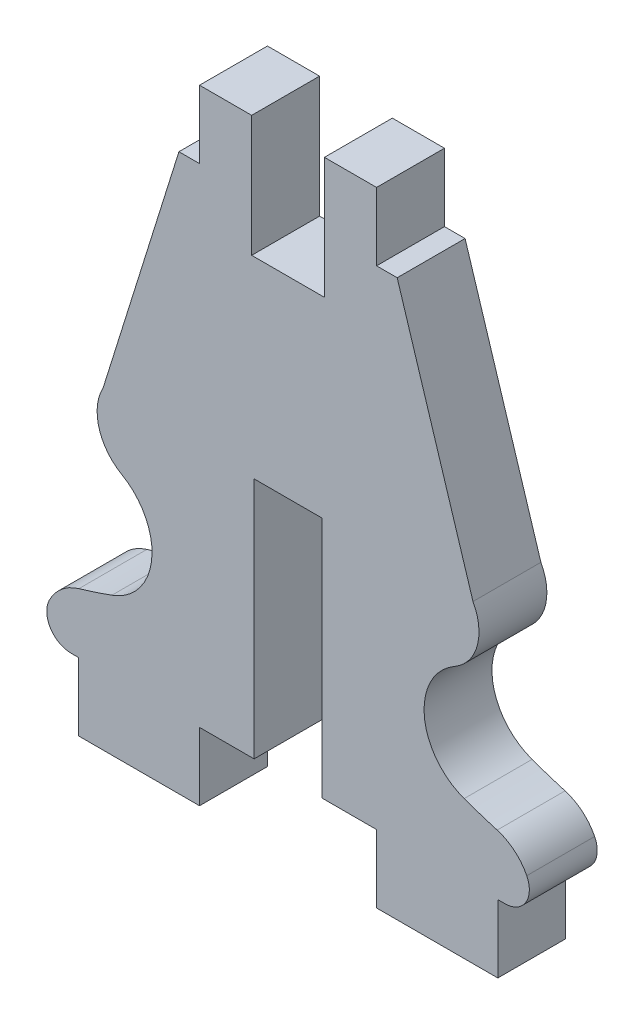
ISO-10303-21;
HEADER;
FILE_DESCRIPTION(('STEP AP214'),'2;1');
FILE_NAME('part.step','',(''),(''),'','','');
FILE_SCHEMA(('AUTOMOTIVE_DESIGN { 1 0 10303 214 1 1 1 1 }'));
ENDSEC;
DATA;
#1=APPLICATION_CONTEXT('core data for automotive mechanical design processes');
#2=APPLICATION_PROTOCOL_DEFINITION('international standard','automotive_design',2000,#1);
#3=PRODUCT_CONTEXT('',#1,'mechanical');
#4=PRODUCT('Part','Part','',(#3));
#5=PRODUCT_RELATED_PRODUCT_CATEGORY('part','',(#4));
#6=PRODUCT_DEFINITION_FORMATION('','',#4);
#7=PRODUCT_DEFINITION_CONTEXT('part definition',#1,'design');
#8=PRODUCT_DEFINITION('design','',#6,#7);
#9=PRODUCT_DEFINITION_SHAPE('','',#8);
#10=(LENGTH_UNIT() NAMED_UNIT(*) SI_UNIT(.MILLI.,.METRE.));
#11=(NAMED_UNIT(*) PLANE_ANGLE_UNIT() SI_UNIT($,.RADIAN.));
#12=(NAMED_UNIT(*) SI_UNIT($,.STERADIAN.) SOLID_ANGLE_UNIT());
#13=UNCERTAINTY_MEASURE_WITH_UNIT(LENGTH_MEASURE(1.E-05),#10,'distance_accuracy_value','');
#14=(GEOMETRIC_REPRESENTATION_CONTEXT(3) GLOBAL_UNCERTAINTY_ASSIGNED_CONTEXT((#13)) GLOBAL_UNIT_ASSIGNED_CONTEXT((#10,
#11,#12)) REPRESENTATION_CONTEXT('',''));
#15=CARTESIAN_POINT('',(0.,0.,0.));
#16=DIRECTION('',(0.,0.,1.));
#17=DIRECTION('',(1.,0.,0.));
#18=AXIS2_PLACEMENT_3D('',#15,#16,#17);
#19=CARTESIAN_POINT('',(-3.65,-2.8,2.8));
#20=DIRECTION('',(0.,1.,0.));
#21=DIRECTION('',(-1.,0.,0.));
#22=AXIS2_PLACEMENT_3D('',#19,#20,#21);
#23=PLANE('',#22);
#24=DIRECTION('',(1.,0.,0.));
#25=VECTOR('',#24,1.);
#26=CARTESIAN_POINT('',(-3.65,-2.8,0.));
#27=LINE('',#26,#25);
#28=CARTESIAN_POINT('',(-8.65,-2.8,0.));
#29=VERTEX_POINT('',#28);
#30=CARTESIAN_POINT('',(-3.65,-2.8,0.));
#31=VERTEX_POINT('',#30);
#32=EDGE_CURVE('E300',#29,#31,#27,.T.);
#33=ORIENTED_EDGE('',*,*,#32,.T.);
#34=DIRECTION('',(0.,0.,-1.));
#35=VECTOR('',#34,1.);
#36=CARTESIAN_POINT('',(-3.65,-2.8,2.8));
#37=LINE('',#36,#35);
#38=CARTESIAN_POINT('',(-3.65,-2.8,2.8));
#39=VERTEX_POINT('',#38);
#40=EDGE_CURVE('E11',#39,#31,#37,.T.);
#41=ORIENTED_EDGE('',*,*,#40,.F.);
#42=DIRECTION('',(1.,0.,0.));
#43=VECTOR('',#42,1.);
#44=CARTESIAN_POINT('',(-3.65,-2.8,2.8));
#45=LINE('',#44,#43);
#46=CARTESIAN_POINT('',(-8.65,-2.8,2.8));
#47=VERTEX_POINT('',#46);
#48=EDGE_CURVE('E400',#47,#39,#45,.T.);
#49=ORIENTED_EDGE('',*,*,#48,.F.);
#50=DIRECTION('',(0.,0.,-1.));
#51=VECTOR('',#50,1.);
#52=CARTESIAN_POINT('',(-8.65,-2.8,2.8));
#53=LINE('',#52,#51);
#54=EDGE_CURVE('E296',#47,#29,#53,.T.);
#55=ORIENTED_EDGE('',*,*,#54,.T.);
#56=EDGE_LOOP('',(#33,#41,#49,#55));
#57=FACE_BOUND('',#56,.T.);
#58=ADVANCED_FACE('F43',(#57),#23,.F.);
#59=CARTESIAN_POINT('',(-3.65,0.,2.8));
#60=DIRECTION('',(-1.,0.,0.));
#61=DIRECTION('',(0.,-1.,0.));
#62=AXIS2_PLACEMENT_3D('',#59,#60,#61);
#63=PLANE('',#62);
#64=DIRECTION('',(0.,1.,0.));
#65=VECTOR('',#64,1.);
#66=CARTESIAN_POINT('',(-3.65,0.,0.));
#67=LINE('',#66,#65);
#68=CARTESIAN_POINT('',(-3.65,0.,0.));
#69=VERTEX_POINT('',#68);
#70=EDGE_CURVE('E304',#31,#69,#67,.T.);
#71=ORIENTED_EDGE('',*,*,#70,.T.);
#72=DIRECTION('',(0.,0.,-1.));
#73=VECTOR('',#72,1.);
#74=CARTESIAN_POINT('',(-3.65,0.,2.8));
#75=LINE('',#74,#73);
#76=CARTESIAN_POINT('',(-3.65,0.,2.8));
#77=VERTEX_POINT('',#76);
#78=EDGE_CURVE('E52',#77,#69,#75,.T.);
#79=ORIENTED_EDGE('',*,*,#78,.F.);
#80=DIRECTION('',(0.,1.,0.));
#81=VECTOR('',#80,1.);
#82=CARTESIAN_POINT('',(-3.65,0.,2.8));
#83=LINE('',#82,#81);
#84=EDGE_CURVE('E181',#39,#77,#83,.T.);
#85=ORIENTED_EDGE('',*,*,#84,.F.);
#86=ORIENTED_EDGE('',*,*,#40,.T.);
#87=EDGE_LOOP('',(#71,#79,#85,#86));
#88=FACE_BOUND('',#87,.T.);
#89=ADVANCED_FACE('F648',(#88),#63,.F.);
#90=CARTESIAN_POINT('',(-1.4,0.,2.8));
#91=DIRECTION('',(0.,1.,0.));
#92=DIRECTION('',(-1.,0.,0.));
#93=AXIS2_PLACEMENT_3D('',#90,#91,#92);
#94=PLANE('',#93);
#95=DIRECTION('',(1.,0.,0.));
#96=VECTOR('',#95,1.);
#97=CARTESIAN_POINT('',(-1.4,0.,0.));
#98=LINE('',#97,#96);
#99=CARTESIAN_POINT('',(-1.4,0.,0.));
#100=VERTEX_POINT('',#99);
#101=EDGE_CURVE('E307',#69,#100,#98,.T.);
#102=ORIENTED_EDGE('',*,*,#101,.T.);
#103=DIRECTION('',(0.,0.,-1.));
#104=VECTOR('',#103,1.);
#105=CARTESIAN_POINT('',(-1.4,0.,2.8));
#106=LINE('',#105,#104);
#107=CARTESIAN_POINT('',(-1.4,0.,2.8));
#108=VERTEX_POINT('',#107);
#109=EDGE_CURVE('E515',#108,#100,#106,.T.);
#110=ORIENTED_EDGE('',*,*,#109,.F.);
#111=DIRECTION('',(1.,0.,0.));
#112=VECTOR('',#111,1.);
#113=CARTESIAN_POINT('',(-1.4,0.,2.8));
#114=LINE('',#113,#112);
#115=EDGE_CURVE('E525',#77,#108,#114,.T.);
#116=ORIENTED_EDGE('',*,*,#115,.F.);
#117=ORIENTED_EDGE('',*,*,#78,.T.);
#118=EDGE_LOOP('',(#102,#110,#116,#117));
#119=FACE_BOUND('',#118,.T.);
#120=ADVANCED_FACE('F523',(#119),#94,.F.);
#121=CARTESIAN_POINT('',(-1.4,10.,2.8));
#122=DIRECTION('',(-1.,0.,0.));
#123=DIRECTION('',(0.,-1.,0.));
#124=AXIS2_PLACEMENT_3D('',#121,#122,#123);
#125=PLANE('',#124);
#126=DIRECTION('',(0.,1.,0.));
#127=VECTOR('',#126,1.);
#128=CARTESIAN_POINT('',(-1.4,10.,0.));
#129=LINE('',#128,#127);
#130=CARTESIAN_POINT('',(-1.4,10.,0.));
#131=VERTEX_POINT('',#130);
#132=EDGE_CURVE('E310',#100,#131,#129,.T.);
#133=ORIENTED_EDGE('',*,*,#132,.T.);
#134=DIRECTION('',(0.,0.,-1.));
#135=VECTOR('',#134,1.);
#136=CARTESIAN_POINT('',(-1.4,10.,2.8));
#137=LINE('',#136,#135);
#138=CARTESIAN_POINT('',(-1.4,10.,2.8));
#139=VERTEX_POINT('',#138);
#140=EDGE_CURVE('E511',#139,#131,#137,.T.);
#141=ORIENTED_EDGE('',*,*,#140,.F.);
#142=DIRECTION('',(0.,1.,0.));
#143=VECTOR('',#142,1.);
#144=CARTESIAN_POINT('',(-1.4,10.,2.8));
#145=LINE('',#144,#143);
#146=EDGE_CURVE('E544',#108,#139,#145,.T.);
#147=ORIENTED_EDGE('',*,*,#146,.F.);
#148=ORIENTED_EDGE('',*,*,#109,.T.);
#149=EDGE_LOOP('',(#133,#141,#147,#148));
#150=FACE_BOUND('',#149,.T.);
#151=ADVANCED_FACE('F534',(#150),#125,.F.);
#152=CARTESIAN_POINT('',(-1.4,10.,2.8));
#153=DIRECTION('',(0.,1.,0.));
#154=DIRECTION('',(0.,0.,1.));
#155=AXIS2_PLACEMENT_3D('',#152,#153,#154);
#156=PLANE('',#155);
#157=DIRECTION('',(1.,0.,0.));
#158=VECTOR('',#157,1.);
#159=CARTESIAN_POINT('',(-1.4,10.,0.));
#160=LINE('',#159,#158);
#161=CARTESIAN_POINT('',(1.4,10.,0.));
#162=VERTEX_POINT('',#161);
#163=EDGE_CURVE('E313',#131,#162,#160,.T.);
#164=ORIENTED_EDGE('',*,*,#163,.T.);
#165=DIRECTION('',(0.,0.,-1.));
#166=VECTOR('',#165,1.);
#167=CARTESIAN_POINT('',(1.4,10.,2.8));
#168=LINE('',#167,#166);
#169=CARTESIAN_POINT('',(1.4,10.,2.8));
#170=VERTEX_POINT('',#169);
#171=EDGE_CURVE('E507',#170,#162,#168,.T.);
#172=ORIENTED_EDGE('',*,*,#171,.F.);
#173=DIRECTION('',(1.,0.,0.));
#174=VECTOR('',#173,1.);
#175=CARTESIAN_POINT('',(-1.4,10.,2.8));
#176=LINE('',#175,#174);
#177=EDGE_CURVE('E540',#139,#170,#176,.T.);
#178=ORIENTED_EDGE('',*,*,#177,.F.);
#179=ORIENTED_EDGE('',*,*,#140,.T.);
#180=EDGE_LOOP('',(#164,#172,#178,#179));
#181=FACE_BOUND('',#180,.T.);
#182=ADVANCED_FACE('F538',(#181),#156,.F.);
#183=CARTESIAN_POINT('',(1.4,10.,2.8));
#184=DIRECTION('',(1.,0.,0.));
#185=DIRECTION('',(0.,1.,0.));
#186=AXIS2_PLACEMENT_3D('',#183,#184,#185);
#187=PLANE('',#186);
#188=DIRECTION('',(0.,-1.,0.));
#189=VECTOR('',#188,1.);
#190=CARTESIAN_POINT('',(1.4,10.,0.));
#191=LINE('',#190,#189);
#192=CARTESIAN_POINT('',(1.4,0.,0.));
#193=VERTEX_POINT('',#192);
#194=EDGE_CURVE('E316',#162,#193,#191,.T.);
#195=ORIENTED_EDGE('',*,*,#194,.T.);
#196=DIRECTION('',(0.,0.,-1.));
#197=VECTOR('',#196,1.);
#198=CARTESIAN_POINT('',(1.4,0.,2.8));
#199=LINE('',#198,#197);
#200=CARTESIAN_POINT('',(1.4,0.,2.8));
#201=VERTEX_POINT('',#200);
#202=EDGE_CURVE('E503',#201,#193,#199,.T.);
#203=ORIENTED_EDGE('',*,*,#202,.F.);
#204=DIRECTION('',(0.,-1.,0.));
#205=VECTOR('',#204,1.);
#206=CARTESIAN_POINT('',(1.4,10.,2.8));
#207=LINE('',#206,#205);
#208=EDGE_CURVE('E543',#170,#201,#207,.T.);
#209=ORIENTED_EDGE('',*,*,#208,.F.);
#210=ORIENTED_EDGE('',*,*,#171,.T.);
#211=EDGE_LOOP('',(#195,#203,#209,#210));
#212=FACE_BOUND('',#211,.T.);
#213=ADVANCED_FACE('F661',(#212),#187,.F.);
#214=CARTESIAN_POINT('',(1.4,0.,2.8));
#215=DIRECTION('',(0.,1.,0.));
#216=DIRECTION('',(-1.,0.,0.));
#217=AXIS2_PLACEMENT_3D('',#214,#215,#216);
#218=PLANE('',#217);
#219=DIRECTION('',(1.,0.,0.));
#220=VECTOR('',#219,1.);
#221=CARTESIAN_POINT('',(1.4,0.,0.));
#222=LINE('',#221,#220);
#223=CARTESIAN_POINT('',(3.65,0.,0.));
#224=VERTEX_POINT('',#223);
#225=EDGE_CURVE('E319',#193,#224,#222,.T.);
#226=ORIENTED_EDGE('',*,*,#225,.T.);
#227=DIRECTION('',(0.,0.,-1.));
#228=VECTOR('',#227,1.);
#229=CARTESIAN_POINT('',(3.65,0.,2.8));
#230=LINE('',#229,#228);
#231=CARTESIAN_POINT('',(3.65,0.,2.8));
#232=VERTEX_POINT('',#231);
#233=EDGE_CURVE('E499',#232,#224,#230,.T.);
#234=ORIENTED_EDGE('',*,*,#233,.F.);
#235=DIRECTION('',(1.,0.,0.));
#236=VECTOR('',#235,1.);
#237=CARTESIAN_POINT('',(1.4,0.,2.8));
#238=LINE('',#237,#236);
#239=EDGE_CURVE('E548',#201,#232,#238,.T.);
#240=ORIENTED_EDGE('',*,*,#239,.F.);
#241=ORIENTED_EDGE('',*,*,#202,.T.);
#242=EDGE_LOOP('',(#226,#234,#240,#241));
#243=FACE_BOUND('',#242,.T.);
#244=ADVANCED_FACE('F664',(#243),#218,.F.);
#245=CARTESIAN_POINT('',(3.65,0.,2.8));
#246=DIRECTION('',(1.,0.,0.));
#247=DIRECTION('',(0.,1.,0.));
#248=AXIS2_PLACEMENT_3D('',#245,#246,#247);
#249=PLANE('',#248);
#250=DIRECTION('',(0.,-1.,0.));
#251=VECTOR('',#250,1.);
#252=CARTESIAN_POINT('',(3.65,0.,0.));
#253=LINE('',#252,#251);
#254=CARTESIAN_POINT('',(3.65,-2.8,0.));
#255=VERTEX_POINT('',#254);
#256=EDGE_CURVE('E322',#224,#255,#253,.T.);
#257=ORIENTED_EDGE('',*,*,#256,.T.);
#258=DIRECTION('',(0.,0.,-1.));
#259=VECTOR('',#258,1.);
#260=CARTESIAN_POINT('',(3.65,-2.8,2.8));
#261=LINE('',#260,#259);
#262=CARTESIAN_POINT('',(3.65,-2.8,2.8));
#263=VERTEX_POINT('',#262);
#264=EDGE_CURVE('E495',#263,#255,#261,.T.);
#265=ORIENTED_EDGE('',*,*,#264,.F.);
#266=DIRECTION('',(0.,-1.,0.));
#267=VECTOR('',#266,1.);
#268=CARTESIAN_POINT('',(3.65,0.,2.8));
#269=LINE('',#268,#267);
#270=EDGE_CURVE('E555',#232,#263,#269,.T.);
#271=ORIENTED_EDGE('',*,*,#270,.F.);
#272=ORIENTED_EDGE('',*,*,#233,.T.);
#273=EDGE_LOOP('',(#257,#265,#271,#272));
#274=FACE_BOUND('',#273,.T.);
#275=ADVANCED_FACE('F668',(#274),#249,.F.);
#276=CARTESIAN_POINT('',(3.65,-2.8,2.8));
#277=DIRECTION('',(0.,1.,0.));
#278=DIRECTION('',(-1.,0.,0.));
#279=AXIS2_PLACEMENT_3D('',#276,#277,#278);
#280=PLANE('',#279);
#281=DIRECTION('',(1.,0.,0.));
#282=VECTOR('',#281,1.);
#283=CARTESIAN_POINT('',(3.65,-2.8,0.));
#284=LINE('',#283,#282);
#285=CARTESIAN_POINT('',(8.65,-2.8,0.));
#286=VERTEX_POINT('',#285);
#287=EDGE_CURVE('E325',#255,#286,#284,.T.);
#288=ORIENTED_EDGE('',*,*,#287,.T.);
#289=DIRECTION('',(0.,0.,-1.));
#290=VECTOR('',#289,1.);
#291=CARTESIAN_POINT('',(8.65,-2.8,2.8));
#292=LINE('',#291,#290);
#293=CARTESIAN_POINT('',(8.65,-2.8,2.8));
#294=VERTEX_POINT('',#293);
#295=EDGE_CURVE('E491',#294,#286,#292,.T.);
#296=ORIENTED_EDGE('',*,*,#295,.F.);
#297=DIRECTION('',(1.,0.,0.));
#298=VECTOR('',#297,1.);
#299=CARTESIAN_POINT('',(3.65,-2.8,2.8));
#300=LINE('',#299,#298);
#301=EDGE_CURVE('E558',#263,#294,#300,.T.);
#302=ORIENTED_EDGE('',*,*,#301,.F.);
#303=ORIENTED_EDGE('',*,*,#264,.T.);
#304=EDGE_LOOP('',(#288,#296,#302,#303));
#305=FACE_BOUND('',#304,.T.);
#306=ADVANCED_FACE('F672',(#305),#280,.F.);
#307=CARTESIAN_POINT('',(8.65,-2.8,2.8));
#308=DIRECTION('',(-1.,0.,0.));
#309=DIRECTION('',(0.,0.,1.));
#310=AXIS2_PLACEMENT_3D('',#307,#308,#309);
#311=PLANE('',#310);
#312=DIRECTION('',(0.,1.,0.));
#313=VECTOR('',#312,1.);
#314=CARTESIAN_POINT('',(8.65,-2.8,0.));
#315=LINE('',#314,#313);
#316=CARTESIAN_POINT('',(8.65,0.,0.));
#317=VERTEX_POINT('',#316);
#318=EDGE_CURVE('E328',#286,#317,#315,.T.);
#319=ORIENTED_EDGE('',*,*,#318,.T.);
#320=DIRECTION('',(0.,0.,-1.));
#321=VECTOR('',#320,1.);
#322=CARTESIAN_POINT('',(8.65,0.,2.8));
#323=LINE('',#322,#321);
#324=CARTESIAN_POINT('',(8.65,0.,2.8));
#325=VERTEX_POINT('',#324);
#326=EDGE_CURVE('E487',#325,#317,#323,.T.);
#327=ORIENTED_EDGE('',*,*,#326,.F.);
#328=DIRECTION('',(0.,1.,0.));
#329=VECTOR('',#328,1.);
#330=CARTESIAN_POINT('',(8.65,-2.8,2.8));
#331=LINE('',#330,#329);
#332=EDGE_CURVE('E561',#294,#325,#331,.T.);
#333=ORIENTED_EDGE('',*,*,#332,.F.);
#334=ORIENTED_EDGE('',*,*,#295,.T.);
#335=EDGE_LOOP('',(#319,#327,#333,#334));
#336=FACE_BOUND('',#335,.T.);
#337=ADVANCED_FACE('F676',(#336),#311,.F.);
#338=CARTESIAN_POINT('',(8.65,0.,2.8));
#339=DIRECTION('',(0.,1.,0.));
#340=DIRECTION('',(-1.,0.,0.));
#341=AXIS2_PLACEMENT_3D('',#338,#339,#340);
#342=PLANE('',#341);
#343=DIRECTION('',(1.,0.,0.));
#344=VECTOR('',#343,1.);
#345=CARTESIAN_POINT('',(8.65,0.,0.));
#346=LINE('',#345,#344);
#347=CARTESIAN_POINT('',(8.94999999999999,0.,0.));
#348=VERTEX_POINT('',#347);
#349=EDGE_CURVE('E331',#317,#348,#346,.T.);
#350=ORIENTED_EDGE('',*,*,#349,.T.);
#351=DIRECTION('',(0.,0.,-1.));
#352=VECTOR('',#351,1.);
#353=CARTESIAN_POINT('',(8.94999999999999,0.,2.8));
#354=LINE('',#353,#352);
#355=CARTESIAN_POINT('',(8.94999999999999,0.,2.8));
#356=VERTEX_POINT('',#355);
#357=EDGE_CURVE('E483',#356,#348,#354,.T.);
#358=ORIENTED_EDGE('',*,*,#357,.F.);
#359=DIRECTION('',(1.,0.,0.));
#360=VECTOR('',#359,1.);
#361=CARTESIAN_POINT('',(8.65,0.,2.8));
#362=LINE('',#361,#360);
#363=EDGE_CURVE('E564',#325,#356,#362,.T.);
#364=ORIENTED_EDGE('',*,*,#363,.F.);
#365=ORIENTED_EDGE('',*,*,#326,.T.);
#366=EDGE_LOOP('',(#350,#358,#364,#365));
#367=FACE_BOUND('',#366,.T.);
#368=ADVANCED_FACE('F680',(#367),#342,.F.);
#369=CARTESIAN_POINT('',(8.95,0.999999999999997,2.8));
#370=DIRECTION('',(0.,0.,-1.));
#371=DIRECTION('',(-1.,0.,0.));
#372=AXIS2_PLACEMENT_3D('',#369,#370,#371);
#373=CYLINDRICAL_SURFACE('',#372,1.);
#374=CARTESIAN_POINT('',(8.95,0.999999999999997,0.));
#375=DIRECTION('',(0.,0.,1.));
#376=DIRECTION('',(1.,0.,0.));
#377=AXIS2_PLACEMENT_3D('',#374,#375,#376);
#378=CIRCLE('',#377,1.);
#379=CARTESIAN_POINT('',(9.84310679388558,1.44984470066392,0.));
#380=VERTEX_POINT('',#379);
#381=EDGE_CURVE('E334',#348,#380,#378,.T.);
#382=ORIENTED_EDGE('',*,*,#381,.T.);
#383=DIRECTION('',(0.,0.,-1.));
#384=VECTOR('',#383,1.);
#385=CARTESIAN_POINT('',(9.84310679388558,1.44984470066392,2.8));
#386=LINE('',#385,#384);
#387=CARTESIAN_POINT('',(9.84310679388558,1.44984470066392,2.8));
#388=VERTEX_POINT('',#387);
#389=EDGE_CURVE('E479',#388,#380,#386,.T.);
#390=ORIENTED_EDGE('',*,*,#389,.F.);
#391=CARTESIAN_POINT('',(8.95,0.999999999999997,2.8));
#392=DIRECTION('',(0.,0.,1.));
#393=DIRECTION('',(1.,0.,0.));
#394=AXIS2_PLACEMENT_3D('',#391,#392,#393);
#395=CIRCLE('',#394,1.);
#396=EDGE_CURVE('E567',#356,#388,#395,.T.);
#397=ORIENTED_EDGE('',*,*,#396,.F.);
#398=ORIENTED_EDGE('',*,*,#357,.T.);
#399=EDGE_LOOP('',(#382,#390,#397,#398));
#400=FACE_BOUND('',#399,.T.);
#401=ADVANCED_FACE('F684',(#400),#373,.T.);
#402=CARTESIAN_POINT('',(8.05689320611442,0.550155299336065,2.8));
#403=DIRECTION('',(0.,0.,-1.));
#404=DIRECTION('',(-1.,0.,0.));
#405=AXIS2_PLACEMENT_3D('',#402,#403,#404);
#406=CYLINDRICAL_SURFACE('',#405,2.);
#407=CARTESIAN_POINT('',(8.05689320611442,0.550155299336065,0.));
#408=DIRECTION('',(0.,0.,1.));
#409=DIRECTION('',(1.,0.,0.));
#410=AXIS2_PLACEMENT_3D('',#407,#408,#409);
#411=CIRCLE('',#410,2.);
#412=CARTESIAN_POINT('',(8.62257182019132,2.46848991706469,0.));
#413=VERTEX_POINT('',#412);
#414=EDGE_CURVE('E337',#380,#413,#411,.T.);
#415=ORIENTED_EDGE('',*,*,#414,.T.);
#416=DIRECTION('',(0.,0.,-1.));
#417=VECTOR('',#416,1.);
#418=CARTESIAN_POINT('',(8.62257182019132,2.46848991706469,2.8));
#419=LINE('',#418,#417);
#420=CARTESIAN_POINT('',(8.62257182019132,2.46848991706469,2.8));
#421=VERTEX_POINT('',#420);
#422=EDGE_CURVE('E475',#421,#413,#419,.T.);
#423=ORIENTED_EDGE('',*,*,#422,.F.);
#424=CARTESIAN_POINT('',(8.05689320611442,0.550155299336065,2.8));
#425=DIRECTION('',(0.,0.,1.));
#426=DIRECTION('',(1.,0.,0.));
#427=AXIS2_PLACEMENT_3D('',#424,#425,#426);
#428=CIRCLE('',#427,2.);
#429=EDGE_CURVE('E570',#388,#421,#428,.T.);
#430=ORIENTED_EDGE('',*,*,#429,.F.);
#431=ORIENTED_EDGE('',*,*,#389,.T.);
#432=EDGE_LOOP('',(#415,#423,#430,#431));
#433=FACE_BOUND('',#432,.T.);
#434=ADVANCED_FACE('F688',(#433),#406,.T.);
#435=CARTESIAN_POINT('',(15.5391267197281,25.9239757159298,2.8));
#436=DIRECTION('',(0.,0.,-1.));
#437=DIRECTION('',(-1.,0.,0.));
#438=AXIS2_PLACEMENT_3D('',#435,#436,#437);
#439=CYLINDRICAL_SURFACE('',#438,24.4540087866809);
#440=CARTESIAN_POINT('',(15.5391267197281,25.9239757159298,0.));
#441=DIRECTION('',(0.,0.,-1.));
#442=DIRECTION('',(-1.,0.,0.));
#443=AXIS2_PLACEMENT_3D('',#440,#441,#442);
#444=CIRCLE('',#443,24.4540087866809);
#445=CARTESIAN_POINT('',(7.26246639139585,2.91320781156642,0.));
#446=VERTEX_POINT('',#445);
#447=EDGE_CURVE('E340',#413,#446,#444,.T.);
#448=ORIENTED_EDGE('',*,*,#447,.T.);
#449=DIRECTION('',(0.,0.,-1.));
#450=VECTOR('',#449,1.);
#451=CARTESIAN_POINT('',(7.26246639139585,2.91320781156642,2.8));
#452=LINE('',#451,#450);
#453=CARTESIAN_POINT('',(7.26246639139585,2.91320781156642,2.8));
#454=VERTEX_POINT('',#453);
#455=EDGE_CURVE('E471',#454,#446,#452,.T.);
#456=ORIENTED_EDGE('',*,*,#455,.F.);
#457=CARTESIAN_POINT('',(15.5391267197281,25.9239757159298,2.8));
#458=DIRECTION('',(0.,0.,-1.));
#459=DIRECTION('',(-1.,0.,0.));
#460=AXIS2_PLACEMENT_3D('',#457,#458,#459);
#461=CIRCLE('',#460,24.4540087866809);
#462=EDGE_CURVE('E573',#421,#454,#461,.T.);
#463=ORIENTED_EDGE('',*,*,#462,.F.);
#464=ORIENTED_EDGE('',*,*,#422,.T.);
#465=EDGE_LOOP('',(#448,#456,#463,#464));
#466=FACE_BOUND('',#465,.T.);
#467=ADVANCED_FACE('F692',(#466),#439,.F.);
#468=CARTESIAN_POINT('',(8.10861194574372,5.26566136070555,2.8));
#469=DIRECTION('',(0.,0.,-1.));
#470=DIRECTION('',(-1.,0.,0.));
#471=AXIS2_PLACEMENT_3D('',#468,#469,#470);
#472=CYLINDRICAL_SURFACE('',#471,2.5);
#473=CARTESIAN_POINT('',(8.10861194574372,5.26566136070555,0.));
#474=DIRECTION('',(0.,0.,-1.));
#475=DIRECTION('',(-1.,0.,0.));
#476=AXIS2_PLACEMENT_3D('',#473,#474,#475);
#477=CIRCLE('',#476,2.5);
#478=CARTESIAN_POINT('',(6.86635920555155,7.43517930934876,0.));
#479=VERTEX_POINT('',#478);
#480=EDGE_CURVE('E343',#446,#479,#477,.T.);
#481=ORIENTED_EDGE('',*,*,#480,.T.);
#482=DIRECTION('',(0.,0.,-1.));
#483=VECTOR('',#482,1.);
#484=CARTESIAN_POINT('',(6.86635920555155,7.43517930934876,2.8));
#485=LINE('',#484,#483);
#486=CARTESIAN_POINT('',(6.86635920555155,7.43517930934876,2.8));
#487=VERTEX_POINT('',#486);
#488=EDGE_CURVE('E467',#487,#479,#485,.T.);
#489=ORIENTED_EDGE('',*,*,#488,.F.);
#490=CARTESIAN_POINT('',(8.10861194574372,5.26566136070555,2.8));
#491=DIRECTION('',(0.,0.,-1.));
#492=DIRECTION('',(-1.,0.,0.));
#493=AXIS2_PLACEMENT_3D('',#490,#491,#492);
#494=CIRCLE('',#493,2.5);
#495=EDGE_CURVE('E576',#454,#487,#494,.T.);
#496=ORIENTED_EDGE('',*,*,#495,.F.);
#497=ORIENTED_EDGE('',*,*,#455,.T.);
#498=EDGE_LOOP('',(#481,#489,#496,#497));
#499=FACE_BOUND('',#498,.T.);
#500=ADVANCED_FACE('F696',(#499),#472,.F.);
#501=CARTESIAN_POINT('',(5.87255701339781,9.17079366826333,2.8));
#502=DIRECTION('',(0.,0.,-1.));
#503=DIRECTION('',(-1.,0.,0.));
#504=AXIS2_PLACEMENT_3D('',#501,#502,#503);
#505=CYLINDRICAL_SURFACE('',#504,2.);
#506=CARTESIAN_POINT('',(5.87255701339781,9.17079366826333,0.));
#507=DIRECTION('',(0.,0.,1.));
#508=DIRECTION('',(1.,0.,0.));
#509=AXIS2_PLACEMENT_3D('',#506,#507,#508);
#510=CIRCLE('',#509,2.);
#511=CARTESIAN_POINT('',(7.62650027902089,10.1318779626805,0.));
#512=VERTEX_POINT('',#511);
#513=EDGE_CURVE('E346',#479,#512,#510,.T.);
#514=ORIENTED_EDGE('',*,*,#513,.T.);
#515=DIRECTION('',(0.,0.,-1.));
#516=VECTOR('',#515,1.);
#517=CARTESIAN_POINT('',(7.62650027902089,10.1318779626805,2.8));
#518=LINE('',#517,#516);
#519=CARTESIAN_POINT('',(7.62650027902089,10.1318779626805,2.8));
#520=VERTEX_POINT('',#519);
#521=EDGE_CURVE('E463',#520,#512,#518,.T.);
#522=ORIENTED_EDGE('',*,*,#521,.F.);
#523=CARTESIAN_POINT('',(5.87255701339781,9.17079366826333,2.8));
#524=DIRECTION('',(0.,0.,1.));
#525=DIRECTION('',(1.,0.,0.));
#526=AXIS2_PLACEMENT_3D('',#523,#524,#525);
#527=CIRCLE('',#526,2.);
#528=EDGE_CURVE('E579',#487,#520,#527,.T.);
#529=ORIENTED_EDGE('',*,*,#528,.F.);
#530=ORIENTED_EDGE('',*,*,#488,.T.);
#531=EDGE_LOOP('',(#514,#522,#529,#530));
#532=FACE_BOUND('',#531,.T.);
#533=ADVANCED_FACE('F700',(#532),#505,.T.);
#534=CARTESIAN_POINT('',(7.62650027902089,10.1318779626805,2.8));
#535=DIRECTION('',(-0.954439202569,-0.298405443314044,0.));
#536=DIRECTION('',(0.298405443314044,-0.954439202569,0.));
#537=AXIS2_PLACEMENT_3D('',#534,#535,#536);
#538=PLANE('',#537);
#539=DIRECTION('',(-0.298405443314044,0.954439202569,0.));
#540=VECTOR('',#539,1.);
#541=CARTESIAN_POINT('',(7.62650027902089,10.1318779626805,0.));
#542=LINE('',#541,#540);
#543=CARTESIAN_POINT('',(4.5,20.1318779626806,0.));
#544=VERTEX_POINT('',#543);
#545=EDGE_CURVE('E349',#512,#544,#542,.T.);
#546=ORIENTED_EDGE('',*,*,#545,.T.);
#547=DIRECTION('',(0.,0.,-1.));
#548=VECTOR('',#547,1.);
#549=CARTESIAN_POINT('',(4.5,20.1318779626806,2.8));
#550=LINE('',#549,#548);
#551=CARTESIAN_POINT('',(4.5,20.1318779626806,2.8));
#552=VERTEX_POINT('',#551);
#553=EDGE_CURVE('E459',#552,#544,#550,.T.);
#554=ORIENTED_EDGE('',*,*,#553,.F.);
#555=DIRECTION('',(-0.298405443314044,0.954439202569,0.));
#556=VECTOR('',#555,1.);
#557=CARTESIAN_POINT('',(7.62650027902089,10.1318779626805,2.8));
#558=LINE('',#557,#556);
#559=EDGE_CURVE('E582',#520,#552,#558,.T.);
#560=ORIENTED_EDGE('',*,*,#559,.F.);
#561=ORIENTED_EDGE('',*,*,#521,.T.);
#562=EDGE_LOOP('',(#546,#554,#560,#561));
#563=FACE_BOUND('',#562,.T.);
#564=ADVANCED_FACE('F704',(#563),#538,.F.);
#565=CARTESIAN_POINT('',(3.65,20.1318779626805,2.8));
#566=DIRECTION('',(0.,-1.,0.));
#567=DIRECTION('',(1.,0.,0.));
#568=AXIS2_PLACEMENT_3D('',#565,#566,#567);
#569=PLANE('',#568);
#570=DIRECTION('',(-1.,0.,0.));
#571=VECTOR('',#570,1.);
#572=CARTESIAN_POINT('',(3.65,20.1318779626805,0.));
#573=LINE('',#572,#571);
#574=CARTESIAN_POINT('',(3.65,20.1318779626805,0.));
#575=VERTEX_POINT('',#574);
#576=EDGE_CURVE('E352',#544,#575,#573,.T.);
#577=ORIENTED_EDGE('',*,*,#576,.T.);
#578=DIRECTION('',(0.,0.,-1.));
#579=VECTOR('',#578,1.);
#580=CARTESIAN_POINT('',(3.65,20.1318779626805,2.8));
#581=LINE('',#580,#579);
#582=CARTESIAN_POINT('',(3.65,20.1318779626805,2.8));
#583=VERTEX_POINT('',#582);
#584=EDGE_CURVE('E455',#583,#575,#581,.T.);
#585=ORIENTED_EDGE('',*,*,#584,.F.);
#586=DIRECTION('',(-1.,0.,0.));
#587=VECTOR('',#586,1.);
#588=CARTESIAN_POINT('',(3.65,20.1318779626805,2.8));
#589=LINE('',#588,#587);
#590=EDGE_CURVE('E585',#552,#583,#589,.T.);
#591=ORIENTED_EDGE('',*,*,#590,.F.);
#592=ORIENTED_EDGE('',*,*,#553,.T.);
#593=EDGE_LOOP('',(#577,#585,#591,#592));
#594=FACE_BOUND('',#593,.T.);
#595=ADVANCED_FACE('F708',(#594),#569,.F.);
#596=CARTESIAN_POINT('',(3.65,22.9318779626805,2.8));
#597=DIRECTION('',(-1.,0.,0.));
#598=DIRECTION('',(0.,-1.,0.));
#599=AXIS2_PLACEMENT_3D('',#596,#597,#598);
#600=PLANE('',#599);
#601=DIRECTION('',(0.,1.,0.));
#602=VECTOR('',#601,1.);
#603=CARTESIAN_POINT('',(3.65,22.9318779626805,0.));
#604=LINE('',#603,#602);
#605=CARTESIAN_POINT('',(3.65,22.9318779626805,0.));
#606=VERTEX_POINT('',#605);
#607=EDGE_CURVE('E355',#575,#606,#604,.T.);
#608=ORIENTED_EDGE('',*,*,#607,.T.);
#609=DIRECTION('',(0.,0.,-1.));
#610=VECTOR('',#609,1.);
#611=CARTESIAN_POINT('',(3.65,22.9318779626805,2.8));
#612=LINE('',#611,#610);
#613=CARTESIAN_POINT('',(3.65,22.9318779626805,2.8));
#614=VERTEX_POINT('',#613);
#615=EDGE_CURVE('E451',#614,#606,#612,.T.);
#616=ORIENTED_EDGE('',*,*,#615,.F.);
#617=DIRECTION('',(0.,1.,0.));
#618=VECTOR('',#617,1.);
#619=CARTESIAN_POINT('',(3.65,22.9318779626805,2.8));
#620=LINE('',#619,#618);
#621=EDGE_CURVE('E588',#583,#614,#620,.T.);
#622=ORIENTED_EDGE('',*,*,#621,.F.);
#623=ORIENTED_EDGE('',*,*,#584,.T.);
#624=EDGE_LOOP('',(#608,#616,#622,#623));
#625=FACE_BOUND('',#624,.T.);
#626=ADVANCED_FACE('F712',(#625),#600,.F.);
#627=CARTESIAN_POINT('',(1.5,22.9318779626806,2.8));
#628=DIRECTION('',(0.,-1.,0.));
#629=DIRECTION('',(1.,0.,0.));
#630=AXIS2_PLACEMENT_3D('',#627,#628,#629);
#631=PLANE('',#630);
#632=DIRECTION('',(-1.,0.,0.));
#633=VECTOR('',#632,1.);
#634=CARTESIAN_POINT('',(1.5,22.9318779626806,0.));
#635=LINE('',#634,#633);
#636=CARTESIAN_POINT('',(1.5,22.9318779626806,0.));
#637=VERTEX_POINT('',#636);
#638=EDGE_CURVE('E358',#606,#637,#635,.T.);
#639=ORIENTED_EDGE('',*,*,#638,.T.);
#640=DIRECTION('',(0.,0.,-1.));
#641=VECTOR('',#640,1.);
#642=CARTESIAN_POINT('',(1.5,22.9318779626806,2.8));
#643=LINE('',#642,#641);
#644=CARTESIAN_POINT('',(1.5,22.9318779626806,2.8));
#645=VERTEX_POINT('',#644);
#646=EDGE_CURVE('E447',#645,#637,#643,.T.);
#647=ORIENTED_EDGE('',*,*,#646,.F.);
#648=DIRECTION('',(-1.,0.,0.));
#649=VECTOR('',#648,1.);
#650=CARTESIAN_POINT('',(1.5,22.9318779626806,2.8));
#651=LINE('',#650,#649);
#652=EDGE_CURVE('E591',#614,#645,#651,.T.);
#653=ORIENTED_EDGE('',*,*,#652,.F.);
#654=ORIENTED_EDGE('',*,*,#615,.T.);
#655=EDGE_LOOP('',(#639,#647,#653,#654));
#656=FACE_BOUND('',#655,.T.);
#657=ADVANCED_FACE('F716',(#656),#631,.F.);
#658=CARTESIAN_POINT('',(1.5,22.9318779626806,2.8));
#659=DIRECTION('',(1.,0.,0.));
#660=DIRECTION('',(0.,1.,0.));
#661=AXIS2_PLACEMENT_3D('',#658,#659,#660);
#662=PLANE('',#661);
#663=DIRECTION('',(0.,-1.,0.));
#664=VECTOR('',#663,1.);
#665=CARTESIAN_POINT('',(1.5,22.9318779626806,0.));
#666=LINE('',#665,#664);
#667=CARTESIAN_POINT('',(1.5,17.9318779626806,0.));
#668=VERTEX_POINT('',#667);
#669=EDGE_CURVE('E361',#637,#668,#666,.T.);
#670=ORIENTED_EDGE('',*,*,#669,.T.);
#671=DIRECTION('',(0.,0.,-1.));
#672=VECTOR('',#671,1.);
#673=CARTESIAN_POINT('',(1.5,17.9318779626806,2.8));
#674=LINE('',#673,#672);
#675=CARTESIAN_POINT('',(1.5,17.9318779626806,2.8));
#676=VERTEX_POINT('',#675);
#677=EDGE_CURVE('E443',#676,#668,#674,.T.);
#678=ORIENTED_EDGE('',*,*,#677,.F.);
#679=DIRECTION('',(0.,-1.,0.));
#680=VECTOR('',#679,1.);
#681=CARTESIAN_POINT('',(1.5,22.9318779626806,2.8));
#682=LINE('',#681,#680);
#683=EDGE_CURVE('E594',#645,#676,#682,.T.);
#684=ORIENTED_EDGE('',*,*,#683,.F.);
#685=ORIENTED_EDGE('',*,*,#646,.T.);
#686=EDGE_LOOP('',(#670,#678,#684,#685));
#687=FACE_BOUND('',#686,.T.);
#688=ADVANCED_FACE('F720',(#687),#662,.F.);
#689=CARTESIAN_POINT('',(-1.5,17.9318779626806,2.8));
#690=DIRECTION('',(0.,-1.,0.));
#691=DIRECTION('',(0.,0.,-1.));
#692=AXIS2_PLACEMENT_3D('',#689,#690,#691);
#693=PLANE('',#692);
#694=DIRECTION('',(-1.,0.,0.));
#695=VECTOR('',#694,1.);
#696=CARTESIAN_POINT('',(-1.5,17.9318779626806,0.));
#697=LINE('',#696,#695);
#698=CARTESIAN_POINT('',(-1.5,17.9318779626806,0.));
#699=VERTEX_POINT('',#698);
#700=EDGE_CURVE('E364',#668,#699,#697,.T.);
#701=ORIENTED_EDGE('',*,*,#700,.T.);
#702=DIRECTION('',(0.,0.,-1.));
#703=VECTOR('',#702,1.);
#704=CARTESIAN_POINT('',(-1.5,17.9318779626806,2.8));
#705=LINE('',#704,#703);
#706=CARTESIAN_POINT('',(-1.5,17.9318779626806,2.8));
#707=VERTEX_POINT('',#706);
#708=EDGE_CURVE('E439',#707,#699,#705,.T.);
#709=ORIENTED_EDGE('',*,*,#708,.F.);
#710=DIRECTION('',(-1.,0.,0.));
#711=VECTOR('',#710,1.);
#712=CARTESIAN_POINT('',(-1.5,17.9318779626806,2.8));
#713=LINE('',#712,#711);
#714=EDGE_CURVE('E597',#676,#707,#713,.T.);
#715=ORIENTED_EDGE('',*,*,#714,.F.);
#716=ORIENTED_EDGE('',*,*,#677,.T.);
#717=EDGE_LOOP('',(#701,#709,#715,#716));
#718=FACE_BOUND('',#717,.T.);
#719=ADVANCED_FACE('F724',(#718),#693,.F.);
#720=CARTESIAN_POINT('',(-1.5,22.9318779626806,2.8));
#721=DIRECTION('',(-1.,0.,0.));
#722=DIRECTION('',(0.,-1.,0.));
#723=AXIS2_PLACEMENT_3D('',#720,#721,#722);
#724=PLANE('',#723);
#725=DIRECTION('',(0.,1.,0.));
#726=VECTOR('',#725,1.);
#727=CARTESIAN_POINT('',(-1.5,22.9318779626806,0.));
#728=LINE('',#727,#726);
#729=CARTESIAN_POINT('',(-1.5,22.9318779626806,0.));
#730=VERTEX_POINT('',#729);
#731=EDGE_CURVE('E367',#699,#730,#728,.T.);
#732=ORIENTED_EDGE('',*,*,#731,.T.);
#733=DIRECTION('',(0.,0.,-1.));
#734=VECTOR('',#733,1.);
#735=CARTESIAN_POINT('',(-1.5,22.9318779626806,2.8));
#736=LINE('',#735,#734);
#737=CARTESIAN_POINT('',(-1.5,22.9318779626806,2.8));
#738=VERTEX_POINT('',#737);
#739=EDGE_CURVE('E435',#738,#730,#736,.T.);
#740=ORIENTED_EDGE('',*,*,#739,.F.);
#741=DIRECTION('',(0.,1.,0.));
#742=VECTOR('',#741,1.);
#743=CARTESIAN_POINT('',(-1.5,22.9318779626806,2.8));
#744=LINE('',#743,#742);
#745=EDGE_CURVE('E600',#707,#738,#744,.T.);
#746=ORIENTED_EDGE('',*,*,#745,.F.);
#747=ORIENTED_EDGE('',*,*,#708,.T.);
#748=EDGE_LOOP('',(#732,#740,#746,#747));
#749=FACE_BOUND('',#748,.T.);
#750=ADVANCED_FACE('F728',(#749),#724,.F.);
#751=CARTESIAN_POINT('',(-3.65,22.9318779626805,2.8));
#752=DIRECTION('',(0.,-1.,0.));
#753=DIRECTION('',(1.,0.,0.));
#754=AXIS2_PLACEMENT_3D('',#751,#752,#753);
#755=PLANE('',#754);
#756=DIRECTION('',(-1.,0.,0.));
#757=VECTOR('',#756,1.);
#758=CARTESIAN_POINT('',(-3.65,22.9318779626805,0.));
#759=LINE('',#758,#757);
#760=CARTESIAN_POINT('',(-3.65,22.9318779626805,0.));
#761=VERTEX_POINT('',#760);
#762=EDGE_CURVE('E370',#730,#761,#759,.T.);
#763=ORIENTED_EDGE('',*,*,#762,.T.);
#764=DIRECTION('',(0.,0.,-1.));
#765=VECTOR('',#764,1.);
#766=CARTESIAN_POINT('',(-3.65,22.9318779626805,2.8));
#767=LINE('',#766,#765);
#768=CARTESIAN_POINT('',(-3.65,22.9318779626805,2.8));
#769=VERTEX_POINT('',#768);
#770=EDGE_CURVE('E431',#769,#761,#767,.T.);
#771=ORIENTED_EDGE('',*,*,#770,.F.);
#772=DIRECTION('',(-1.,0.,0.));
#773=VECTOR('',#772,1.);
#774=CARTESIAN_POINT('',(-3.65,22.9318779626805,2.8));
#775=LINE('',#774,#773);
#776=EDGE_CURVE('E603',#738,#769,#775,.T.);
#777=ORIENTED_EDGE('',*,*,#776,.F.);
#778=ORIENTED_EDGE('',*,*,#739,.T.);
#779=EDGE_LOOP('',(#763,#771,#777,#778));
#780=FACE_BOUND('',#779,.T.);
#781=ADVANCED_FACE('F732',(#780),#755,.F.);
#782=CARTESIAN_POINT('',(-3.65,20.1318779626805,2.8));
#783=DIRECTION('',(1.,0.,0.));
#784=DIRECTION('',(0.,0.,-1.));
#785=AXIS2_PLACEMENT_3D('',#782,#783,#784);
#786=PLANE('',#785);
#787=DIRECTION('',(0.,-1.,0.));
#788=VECTOR('',#787,1.);
#789=CARTESIAN_POINT('',(-3.65,20.1318779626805,0.));
#790=LINE('',#789,#788);
#791=CARTESIAN_POINT('',(-3.65,20.1318779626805,0.));
#792=VERTEX_POINT('',#791);
#793=EDGE_CURVE('E373',#761,#792,#790,.T.);
#794=ORIENTED_EDGE('',*,*,#793,.T.);
#795=DIRECTION('',(0.,0.,-1.));
#796=VECTOR('',#795,1.);
#797=CARTESIAN_POINT('',(-3.65,20.1318779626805,2.8));
#798=LINE('',#797,#796);
#799=CARTESIAN_POINT('',(-3.65,20.1318779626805,2.8));
#800=VERTEX_POINT('',#799);
#801=EDGE_CURVE('E427',#800,#792,#798,.T.);
#802=ORIENTED_EDGE('',*,*,#801,.F.);
#803=DIRECTION('',(0.,-1.,0.));
#804=VECTOR('',#803,1.);
#805=CARTESIAN_POINT('',(-3.65,20.1318779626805,2.8));
#806=LINE('',#805,#804);
#807=EDGE_CURVE('E606',#769,#800,#806,.T.);
#808=ORIENTED_EDGE('',*,*,#807,.F.);
#809=ORIENTED_EDGE('',*,*,#770,.T.);
#810=EDGE_LOOP('',(#794,#802,#808,#809));
#811=FACE_BOUND('',#810,.T.);
#812=ADVANCED_FACE('F736',(#811),#786,.F.);
#813=CARTESIAN_POINT('',(-4.5,20.1318779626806,2.8));
#814=DIRECTION('',(0.,-1.,0.));
#815=DIRECTION('',(1.,0.,0.));
#816=AXIS2_PLACEMENT_3D('',#813,#814,#815);
#817=PLANE('',#816);
#818=DIRECTION('',(-1.,0.,0.));
#819=VECTOR('',#818,1.);
#820=CARTESIAN_POINT('',(-4.5,20.1318779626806,0.));
#821=LINE('',#820,#819);
#822=CARTESIAN_POINT('',(-4.5,20.1318779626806,0.));
#823=VERTEX_POINT('',#822);
#824=EDGE_CURVE('E376',#792,#823,#821,.T.);
#825=ORIENTED_EDGE('',*,*,#824,.T.);
#826=DIRECTION('',(0.,0.,-1.));
#827=VECTOR('',#826,1.);
#828=CARTESIAN_POINT('',(-4.5,20.1318779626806,2.8));
#829=LINE('',#828,#827);
#830=CARTESIAN_POINT('',(-4.5,20.1318779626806,2.8));
#831=VERTEX_POINT('',#830);
#832=EDGE_CURVE('E423',#831,#823,#829,.T.);
#833=ORIENTED_EDGE('',*,*,#832,.F.);
#834=DIRECTION('',(-1.,0.,0.));
#835=VECTOR('',#834,1.);
#836=CARTESIAN_POINT('',(-4.5,20.1318779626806,2.8));
#837=LINE('',#836,#835);
#838=EDGE_CURVE('E609',#800,#831,#837,.T.);
#839=ORIENTED_EDGE('',*,*,#838,.F.);
#840=ORIENTED_EDGE('',*,*,#801,.T.);
#841=EDGE_LOOP('',(#825,#833,#839,#840));
#842=FACE_BOUND('',#841,.T.);
#843=ADVANCED_FACE('F740',(#842),#817,.F.);
#844=CARTESIAN_POINT('',(-7.62650027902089,10.1318779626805,2.8));
#845=DIRECTION('',(0.954439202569,-0.298405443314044,0.));
#846=DIRECTION('',(0.298405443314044,0.954439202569,0.));
#847=AXIS2_PLACEMENT_3D('',#844,#845,#846);
#848=PLANE('',#847);
#849=DIRECTION('',(-0.298405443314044,-0.954439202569,0.));
#850=VECTOR('',#849,1.);
#851=CARTESIAN_POINT('',(-7.62650027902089,10.1318779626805,0.));
#852=LINE('',#851,#850);
#853=CARTESIAN_POINT('',(-7.62650027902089,10.1318779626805,0.));
#854=VERTEX_POINT('',#853);
#855=EDGE_CURVE('E379',#823,#854,#852,.T.);
#856=ORIENTED_EDGE('',*,*,#855,.T.);
#857=DIRECTION('',(0.,0.,-1.));
#858=VECTOR('',#857,1.);
#859=CARTESIAN_POINT('',(-7.62650027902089,10.1318779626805,2.8));
#860=LINE('',#859,#858);
#861=CARTESIAN_POINT('',(-7.62650027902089,10.1318779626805,2.8));
#862=VERTEX_POINT('',#861);
#863=EDGE_CURVE('E419',#862,#854,#860,.T.);
#864=ORIENTED_EDGE('',*,*,#863,.F.);
#865=DIRECTION('',(-0.298405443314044,-0.954439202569,0.));
#866=VECTOR('',#865,1.);
#867=CARTESIAN_POINT('',(-7.62650027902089,10.1318779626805,2.8));
#868=LINE('',#867,#866);
#869=EDGE_CURVE('E612',#831,#862,#868,.T.);
#870=ORIENTED_EDGE('',*,*,#869,.F.);
#871=ORIENTED_EDGE('',*,*,#832,.T.);
#872=EDGE_LOOP('',(#856,#864,#870,#871));
#873=FACE_BOUND('',#872,.T.);
#874=ADVANCED_FACE('F744',(#873),#848,.F.);
#875=CARTESIAN_POINT('',(-5.87255701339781,9.17079366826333,2.8));
#876=DIRECTION('',(0.,0.,-1.));
#877=DIRECTION('',(-1.,0.,0.));
#878=AXIS2_PLACEMENT_3D('',#875,#876,#877);
#879=CYLINDRICAL_SURFACE('',#878,2.);
#880=CARTESIAN_POINT('',(-5.87255701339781,9.17079366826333,0.));
#881=DIRECTION('',(0.,0.,1.));
#882=DIRECTION('',(-1.,0.,0.));
#883=AXIS2_PLACEMENT_3D('',#880,#881,#882);
#884=CIRCLE('',#883,2.);
#885=CARTESIAN_POINT('',(-6.86635920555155,7.43517930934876,0.));
#886=VERTEX_POINT('',#885);
#887=EDGE_CURVE('E382',#854,#886,#884,.T.);
#888=ORIENTED_EDGE('',*,*,#887,.T.);
#889=DIRECTION('',(0.,0.,-1.));
#890=VECTOR('',#889,1.);
#891=CARTESIAN_POINT('',(-6.86635920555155,7.43517930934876,2.8));
#892=LINE('',#891,#890);
#893=CARTESIAN_POINT('',(-6.86635920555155,7.43517930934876,2.8));
#894=VERTEX_POINT('',#893);
#895=EDGE_CURVE('E415',#894,#886,#892,.T.);
#896=ORIENTED_EDGE('',*,*,#895,.F.);
#897=CARTESIAN_POINT('',(-5.87255701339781,9.17079366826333,2.8));
#898=DIRECTION('',(0.,0.,1.));
#899=DIRECTION('',(-1.,0.,0.));
#900=AXIS2_PLACEMENT_3D('',#897,#898,#899);
#901=CIRCLE('',#900,2.);
#902=EDGE_CURVE('E615',#862,#894,#901,.T.);
#903=ORIENTED_EDGE('',*,*,#902,.F.);
#904=ORIENTED_EDGE('',*,*,#863,.T.);
#905=EDGE_LOOP('',(#888,#896,#903,#904));
#906=FACE_BOUND('',#905,.T.);
#907=ADVANCED_FACE('F748',(#906),#879,.T.);
#908=CARTESIAN_POINT('',(-8.10861194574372,5.26566136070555,2.8));
#909=DIRECTION('',(0.,0.,-1.));
#910=DIRECTION('',(-1.,0.,0.));
#911=AXIS2_PLACEMENT_3D('',#908,#909,#910);
#912=CYLINDRICAL_SURFACE('',#911,2.5);
#913=CARTESIAN_POINT('',(-8.10861194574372,5.26566136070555,0.));
#914=DIRECTION('',(0.,0.,-1.));
#915=DIRECTION('',(1.,0.,0.));
#916=AXIS2_PLACEMENT_3D('',#913,#914,#915);
#917=CIRCLE('',#916,2.5);
#918=CARTESIAN_POINT('',(-7.26246639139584,2.91320781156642,0.));
#919=VERTEX_POINT('',#918);
#920=EDGE_CURVE('E385',#886,#919,#917,.T.);
#921=ORIENTED_EDGE('',*,*,#920,.T.);
#922=DIRECTION('',(0.,0.,-1.));
#923=VECTOR('',#922,1.);
#924=CARTESIAN_POINT('',(-7.26246639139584,2.91320781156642,2.8));
#925=LINE('',#924,#923);
#926=CARTESIAN_POINT('',(-7.26246639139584,2.91320781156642,2.8));
#927=VERTEX_POINT('',#926);
#928=EDGE_CURVE('E411',#927,#919,#925,.T.);
#929=ORIENTED_EDGE('',*,*,#928,.F.);
#930=CARTESIAN_POINT('',(-8.10861194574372,5.26566136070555,2.8));
#931=DIRECTION('',(0.,0.,-1.));
#932=DIRECTION('',(1.,0.,0.));
#933=AXIS2_PLACEMENT_3D('',#930,#931,#932);
#934=CIRCLE('',#933,2.5);
#935=EDGE_CURVE('E618',#894,#927,#934,.T.);
#936=ORIENTED_EDGE('',*,*,#935,.F.);
#937=ORIENTED_EDGE('',*,*,#895,.T.);
#938=EDGE_LOOP('',(#921,#929,#936,#937));
#939=FACE_BOUND('',#938,.T.);
#940=ADVANCED_FACE('F752',(#939),#912,.F.);
#941=CARTESIAN_POINT('',(-15.5391267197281,25.9239757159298,2.8));
#942=DIRECTION('',(0.,0.,-1.));
#943=DIRECTION('',(-1.,0.,0.));
#944=AXIS2_PLACEMENT_3D('',#941,#942,#943);
#945=CYLINDRICAL_SURFACE('',#944,24.4540087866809);
#946=CARTESIAN_POINT('',(-15.5391267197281,25.9239757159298,0.));
#947=DIRECTION('',(0.,0.,-1.));
#948=DIRECTION('',(1.,0.,0.));
#949=AXIS2_PLACEMENT_3D('',#946,#947,#948);
#950=CIRCLE('',#949,24.4540087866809);
#951=CARTESIAN_POINT('',(-8.6225718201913,2.46848991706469,0.));
#952=VERTEX_POINT('',#951);
#953=EDGE_CURVE('E388',#919,#952,#950,.T.);
#954=ORIENTED_EDGE('',*,*,#953,.T.);
#955=DIRECTION('',(0.,0.,-1.));
#956=VECTOR('',#955,1.);
#957=CARTESIAN_POINT('',(-8.6225718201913,2.46848991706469,2.8));
#958=LINE('',#957,#956);
#959=CARTESIAN_POINT('',(-8.6225718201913,2.46848991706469,2.8));
#960=VERTEX_POINT('',#959);
#961=EDGE_CURVE('E407',#960,#952,#958,.T.);
#962=ORIENTED_EDGE('',*,*,#961,.F.);
#963=CARTESIAN_POINT('',(-15.5391267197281,25.9239757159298,2.8));
#964=DIRECTION('',(0.,0.,-1.));
#965=DIRECTION('',(1.,0.,0.));
#966=AXIS2_PLACEMENT_3D('',#963,#964,#965);
#967=CIRCLE('',#966,24.4540087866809);
#968=EDGE_CURVE('E621',#927,#960,#967,.T.);
#969=ORIENTED_EDGE('',*,*,#968,.F.);
#970=ORIENTED_EDGE('',*,*,#928,.T.);
#971=EDGE_LOOP('',(#954,#962,#969,#970));
#972=FACE_BOUND('',#971,.T.);
#973=ADVANCED_FACE('F629',(#972),#945,.F.);
#974=CARTESIAN_POINT('',(-8.05689320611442,0.550155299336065,2.8));
#975=DIRECTION('',(0.,0.,-1.));
#976=DIRECTION('',(-1.,0.,0.));
#977=AXIS2_PLACEMENT_3D('',#974,#975,#976);
#978=CYLINDRICAL_SURFACE('',#977,2.);
#979=CARTESIAN_POINT('',(-8.05689320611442,0.550155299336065,0.));
#980=DIRECTION('',(0.,0.,1.));
#981=DIRECTION('',(-1.,0.,0.));
#982=AXIS2_PLACEMENT_3D('',#979,#980,#981);
#983=CIRCLE('',#982,2.);
#984=CARTESIAN_POINT('',(-9.84310679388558,1.44984470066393,0.));
#985=VERTEX_POINT('',#984);
#986=EDGE_CURVE('E391',#952,#985,#983,.T.);
#987=ORIENTED_EDGE('',*,*,#986,.T.);
#988=DIRECTION('',(0.,0.,-1.));
#989=VECTOR('',#988,1.);
#990=CARTESIAN_POINT('',(-9.84310679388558,1.44984470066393,2.8));
#991=LINE('',#990,#989);
#992=CARTESIAN_POINT('',(-9.84310679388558,1.44984470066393,2.8));
#993=VERTEX_POINT('',#992);
#994=EDGE_CURVE('E289',#993,#985,#991,.T.);
#995=ORIENTED_EDGE('',*,*,#994,.F.);
#996=CARTESIAN_POINT('',(-8.05689320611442,0.550155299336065,2.8));
#997=DIRECTION('',(0.,0.,1.));
#998=DIRECTION('',(-1.,0.,0.));
#999=AXIS2_PLACEMENT_3D('',#996,#997,#998);
#1000=CIRCLE('',#999,2.);
#1001=EDGE_CURVE('E278',#960,#993,#1000,.T.);
#1002=ORIENTED_EDGE('',*,*,#1001,.F.);
#1003=ORIENTED_EDGE('',*,*,#961,.T.);
#1004=EDGE_LOOP('',(#987,#995,#1002,#1003));
#1005=FACE_BOUND('',#1004,.T.);
#1006=ADVANCED_FACE('F633',(#1005),#978,.T.);
#1007=CARTESIAN_POINT('',(-8.95,0.999999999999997,2.8));
#1008=DIRECTION('',(0.,0.,-1.));
#1009=DIRECTION('',(-1.,0.,0.));
#1010=AXIS2_PLACEMENT_3D('',#1007,#1008,#1009);
#1011=CYLINDRICAL_SURFACE('',#1010,1.);
#1012=CARTESIAN_POINT('',(-8.95,0.999999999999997,0.));
#1013=DIRECTION('',(0.,0.,1.));
#1014=DIRECTION('',(-1.,0.,0.));
#1015=AXIS2_PLACEMENT_3D('',#1012,#1013,#1014);
#1016=CIRCLE('',#1015,1.);
#1017=CARTESIAN_POINT('',(-8.94999999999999,0.,0.));
#1018=VERTEX_POINT('',#1017);
#1019=EDGE_CURVE('E287',#985,#1018,#1016,.T.);
#1020=ORIENTED_EDGE('',*,*,#1019,.T.);
#1021=DIRECTION('',(0.,0.,-1.));
#1022=VECTOR('',#1021,1.);
#1023=CARTESIAN_POINT('',(-8.94999999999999,0.,2.8));
#1024=LINE('',#1023,#1022);
#1025=CARTESIAN_POINT('',(-8.94999999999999,0.,2.8));
#1026=VERTEX_POINT('',#1025);
#1027=EDGE_CURVE('E284',#1026,#1018,#1024,.T.);
#1028=ORIENTED_EDGE('',*,*,#1027,.F.);
#1029=CARTESIAN_POINT('',(-8.95,0.999999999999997,2.8));
#1030=DIRECTION('',(0.,0.,1.));
#1031=DIRECTION('',(-1.,0.,0.));
#1032=AXIS2_PLACEMENT_3D('',#1029,#1030,#1031);
#1033=CIRCLE('',#1032,1.);
#1034=EDGE_CURVE('E272',#993,#1026,#1033,.T.);
#1035=ORIENTED_EDGE('',*,*,#1034,.F.);
#1036=ORIENTED_EDGE('',*,*,#994,.T.);
#1037=EDGE_LOOP('',(#1020,#1028,#1035,#1036));
#1038=FACE_BOUND('',#1037,.T.);
#1039=ADVANCED_FACE('F285',(#1038),#1011,.T.);
#1040=CARTESIAN_POINT('',(-8.65,0.,2.8));
#1041=DIRECTION('',(0.,1.,0.));
#1042=DIRECTION('',(-1.,0.,0.));
#1043=AXIS2_PLACEMENT_3D('',#1040,#1041,#1042);
#1044=PLANE('',#1043);
#1045=DIRECTION('',(1.,0.,0.));
#1046=VECTOR('',#1045,1.);
#1047=CARTESIAN_POINT('',(-8.65,0.,0.));
#1048=LINE('',#1047,#1046);
#1049=CARTESIAN_POINT('',(-8.65,0.,0.));
#1050=VERTEX_POINT('',#1049);
#1051=EDGE_CURVE('E167',#1018,#1050,#1048,.T.);
#1052=ORIENTED_EDGE('',*,*,#1051,.T.);
#1053=DIRECTION('',(0.,0.,-1.));
#1054=VECTOR('',#1053,1.);
#1055=CARTESIAN_POINT('',(-8.65,0.,2.8));
#1056=LINE('',#1055,#1054);
#1057=CARTESIAN_POINT('',(-8.65,0.,2.8));
#1058=VERTEX_POINT('',#1057);
#1059=EDGE_CURVE('E290',#1058,#1050,#1056,.T.);
#1060=ORIENTED_EDGE('',*,*,#1059,.F.);
#1061=DIRECTION('',(1.,0.,0.));
#1062=VECTOR('',#1061,1.);
#1063=CARTESIAN_POINT('',(-8.65,0.,2.8));
#1064=LINE('',#1063,#1062);
#1065=EDGE_CURVE('E276',#1026,#1058,#1064,.T.);
#1066=ORIENTED_EDGE('',*,*,#1065,.F.);
#1067=ORIENTED_EDGE('',*,*,#1027,.T.);
#1068=EDGE_LOOP('',(#1052,#1060,#1066,#1067));
#1069=FACE_BOUND('',#1068,.T.);
#1070=ADVANCED_FACE('F292',(#1069),#1044,.F.);
#1071=CARTESIAN_POINT('',(-8.65,-2.8,2.8));
#1072=DIRECTION('',(1.,0.,0.));
#1073=DIRECTION('',(0.,0.,-1.));
#1074=AXIS2_PLACEMENT_3D('',#1071,#1072,#1073);
#1075=PLANE('',#1074);
#1076=DIRECTION('',(0.,-1.,0.));
#1077=VECTOR('',#1076,1.);
#1078=CARTESIAN_POINT('',(-8.65,-2.8,0.));
#1079=LINE('',#1078,#1077);
#1080=EDGE_CURVE('E173',#1050,#29,#1079,.T.);
#1081=ORIENTED_EDGE('',*,*,#1080,.T.);
#1082=ORIENTED_EDGE('',*,*,#54,.F.);
#1083=DIRECTION('',(0.,-1.,0.));
#1084=VECTOR('',#1083,1.);
#1085=CARTESIAN_POINT('',(-8.65,-2.8,2.8));
#1086=LINE('',#1085,#1084);
#1087=EDGE_CURVE('E60',#1058,#47,#1086,.T.);
#1088=ORIENTED_EDGE('',*,*,#1087,.F.);
#1089=ORIENTED_EDGE('',*,*,#1059,.T.);
#1090=EDGE_LOOP('',(#1081,#1082,#1088,#1089));
#1091=FACE_BOUND('',#1090,.T.);
#1092=ADVANCED_FACE('F637',(#1091),#1075,.F.);
#1093=CARTESIAN_POINT('',(-8.95,0.999999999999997,2.8));
#1094=DIRECTION('',(0.,0.,-1.));
#1095=DIRECTION('',(-1.,0.,0.));
#1096=AXIS2_PLACEMENT_3D('',#1093,#1094,#1095);
#1097=PLANE('',#1096);
#1098=ORIENTED_EDGE('',*,*,#48,.T.);
#1099=ORIENTED_EDGE('',*,*,#84,.T.);
#1100=ORIENTED_EDGE('',*,*,#115,.T.);
#1101=ORIENTED_EDGE('',*,*,#146,.T.);
#1102=ORIENTED_EDGE('',*,*,#177,.T.);
#1103=ORIENTED_EDGE('',*,*,#208,.T.);
#1104=ORIENTED_EDGE('',*,*,#239,.T.);
#1105=ORIENTED_EDGE('',*,*,#270,.T.);
#1106=ORIENTED_EDGE('',*,*,#301,.T.);
#1107=ORIENTED_EDGE('',*,*,#332,.T.);
#1108=ORIENTED_EDGE('',*,*,#363,.T.);
#1109=ORIENTED_EDGE('',*,*,#396,.T.);
#1110=ORIENTED_EDGE('',*,*,#429,.T.);
#1111=ORIENTED_EDGE('',*,*,#462,.T.);
#1112=ORIENTED_EDGE('',*,*,#495,.T.);
#1113=ORIENTED_EDGE('',*,*,#528,.T.);
#1114=ORIENTED_EDGE('',*,*,#559,.T.);
#1115=ORIENTED_EDGE('',*,*,#590,.T.);
#1116=ORIENTED_EDGE('',*,*,#621,.T.);
#1117=ORIENTED_EDGE('',*,*,#652,.T.);
#1118=ORIENTED_EDGE('',*,*,#683,.T.);
#1119=ORIENTED_EDGE('',*,*,#714,.T.);
#1120=ORIENTED_EDGE('',*,*,#745,.T.);
#1121=ORIENTED_EDGE('',*,*,#776,.T.);
#1122=ORIENTED_EDGE('',*,*,#807,.T.);
#1123=ORIENTED_EDGE('',*,*,#838,.T.);
#1124=ORIENTED_EDGE('',*,*,#869,.T.);
#1125=ORIENTED_EDGE('',*,*,#902,.T.);
#1126=ORIENTED_EDGE('',*,*,#935,.T.);
#1127=ORIENTED_EDGE('',*,*,#968,.T.);
#1128=ORIENTED_EDGE('',*,*,#1001,.T.);
#1129=ORIENTED_EDGE('',*,*,#1034,.T.);
#1130=ORIENTED_EDGE('',*,*,#1065,.T.);
#1131=ORIENTED_EDGE('',*,*,#1087,.T.);
#1132=EDGE_LOOP('',(#1098,#1099,#1100,#1101,#1102,#1103,#1104,#1105,#1106,#1107,#1108,#1109,
#1110,#1111,#1112,#1113,#1114,#1115,#1116,#1117,#1118,#1119,#1120,#1121,#1122,#1123,#1124,#1125,
#1126,#1127,#1128,#1129,#1130,#1131));
#1133=FACE_BOUND('',#1132,.T.);
#1134=ADVANCED_FACE('F274',(#1133),#1097,.F.);
#1135=CARTESIAN_POINT('',(-8.95,0.999999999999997,0.));
#1136=DIRECTION('',(0.,0.,-1.));
#1137=DIRECTION('',(-1.,0.,0.));
#1138=AXIS2_PLACEMENT_3D('',#1135,#1136,#1137);
#1139=PLANE('',#1138);
#1140=ORIENTED_EDGE('',*,*,#32,.F.);
#1141=ORIENTED_EDGE('',*,*,#1080,.F.);
#1142=ORIENTED_EDGE('',*,*,#1051,.F.);
#1143=ORIENTED_EDGE('',*,*,#1019,.F.);
#1144=ORIENTED_EDGE('',*,*,#986,.F.);
#1145=ORIENTED_EDGE('',*,*,#953,.F.);
#1146=ORIENTED_EDGE('',*,*,#920,.F.);
#1147=ORIENTED_EDGE('',*,*,#887,.F.);
#1148=ORIENTED_EDGE('',*,*,#855,.F.);
#1149=ORIENTED_EDGE('',*,*,#824,.F.);
#1150=ORIENTED_EDGE('',*,*,#793,.F.);
#1151=ORIENTED_EDGE('',*,*,#762,.F.);
#1152=ORIENTED_EDGE('',*,*,#731,.F.);
#1153=ORIENTED_EDGE('',*,*,#700,.F.);
#1154=ORIENTED_EDGE('',*,*,#669,.F.);
#1155=ORIENTED_EDGE('',*,*,#638,.F.);
#1156=ORIENTED_EDGE('',*,*,#607,.F.);
#1157=ORIENTED_EDGE('',*,*,#576,.F.);
#1158=ORIENTED_EDGE('',*,*,#545,.F.);
#1159=ORIENTED_EDGE('',*,*,#513,.F.);
#1160=ORIENTED_EDGE('',*,*,#480,.F.);
#1161=ORIENTED_EDGE('',*,*,#447,.F.);
#1162=ORIENTED_EDGE('',*,*,#414,.F.);
#1163=ORIENTED_EDGE('',*,*,#381,.F.);
#1164=ORIENTED_EDGE('',*,*,#349,.F.);
#1165=ORIENTED_EDGE('',*,*,#318,.F.);
#1166=ORIENTED_EDGE('',*,*,#287,.F.);
#1167=ORIENTED_EDGE('',*,*,#256,.F.);
#1168=ORIENTED_EDGE('',*,*,#225,.F.);
#1169=ORIENTED_EDGE('',*,*,#194,.F.);
#1170=ORIENTED_EDGE('',*,*,#163,.F.);
#1171=ORIENTED_EDGE('',*,*,#132,.F.);
#1172=ORIENTED_EDGE('',*,*,#101,.F.);
#1173=ORIENTED_EDGE('',*,*,#70,.F.);
#1174=EDGE_LOOP('',(#1140,#1141,#1142,#1143,#1144,#1145,#1146,#1147,#1148,#1149,#1150,#1151,
#1152,#1153,#1154,#1155,#1156,#1157,#1158,#1159,#1160,#1161,#1162,#1163,#1164,#1165,#1166,#1167,
#1168,#1169,#1170,#1171,#1172,#1173));
#1175=FACE_BOUND('',#1174,.T.);
#1176=ADVANCED_FACE('F529',(#1175),#1139,.T.);
#1177=CLOSED_SHELL('',(#58,#89,#120,#151,#182,#213,#244,#275,#306,#337,#368,#401,#434,#467,#500,
#533,#564,#595,#626,#657,#688,#719,#750,#781,#812,#843,#874,#907,#940,#973,#1006,#1039,#1070,
#1092,#1134,#1176));
#1178=MANIFOLD_SOLID_BREP('B2',#1177);
#1179=ADVANCED_BREP_SHAPE_REPRESENTATION('',(#18,#1178),#14);
#1180=SHAPE_DEFINITION_REPRESENTATION(#9,#1179);
ENDSEC;
END-ISO-10303-21;
